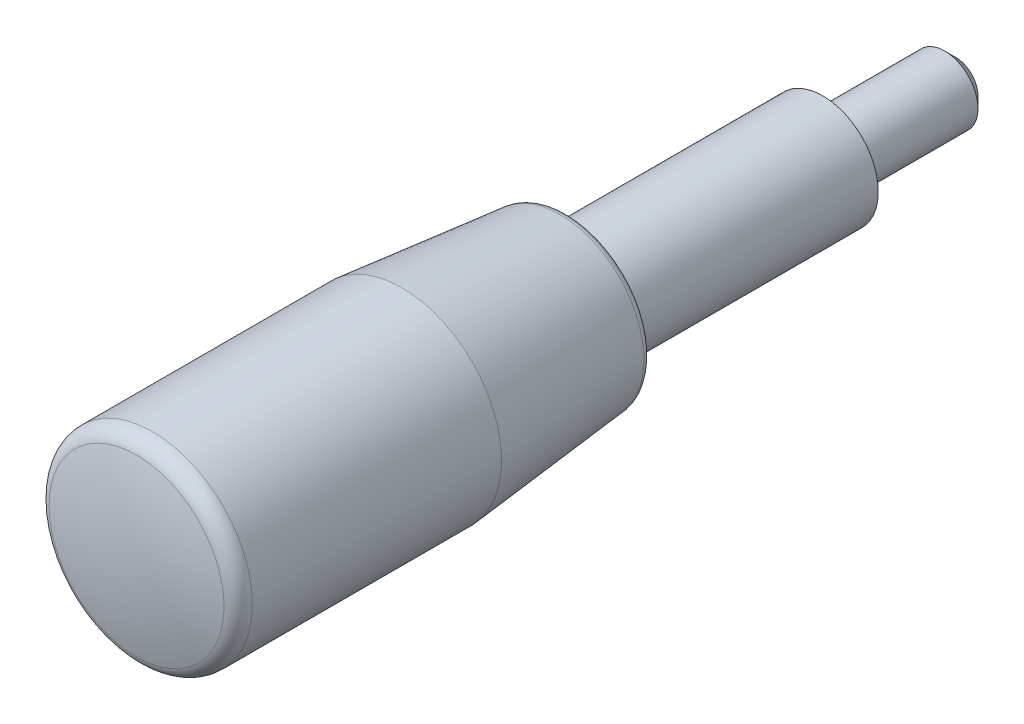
ISO-10303-21;
HEADER;
FILE_DESCRIPTION(('STEP AP214'),'2;1');
FILE_NAME('part.step','',(''),(''),'','','');
FILE_SCHEMA(('AUTOMOTIVE_DESIGN { 1 0 10303 214 1 1 1 1 }'));
ENDSEC;
DATA;
#1=APPLICATION_CONTEXT('core data for automotive mechanical design processes');
#2=APPLICATION_PROTOCOL_DEFINITION('international standard','automotive_design',2000,#1);
#3=PRODUCT_CONTEXT('',#1,'mechanical');
#4=PRODUCT('Part','Part','',(#3));
#5=PRODUCT_RELATED_PRODUCT_CATEGORY('part','',(#4));
#6=PRODUCT_DEFINITION_FORMATION('','',#4);
#7=PRODUCT_DEFINITION_CONTEXT('part definition',#1,'design');
#8=PRODUCT_DEFINITION('design','',#6,#7);
#9=PRODUCT_DEFINITION_SHAPE('','',#8);
#10=(LENGTH_UNIT() NAMED_UNIT(*) SI_UNIT(.MILLI.,.METRE.));
#11=(NAMED_UNIT(*) PLANE_ANGLE_UNIT() SI_UNIT($,.RADIAN.));
#12=(NAMED_UNIT(*) SI_UNIT($,.STERADIAN.) SOLID_ANGLE_UNIT());
#13=UNCERTAINTY_MEASURE_WITH_UNIT(LENGTH_MEASURE(1.E-05),#10,'distance_accuracy_value','');
#14=(GEOMETRIC_REPRESENTATION_CONTEXT(3) GLOBAL_UNCERTAINTY_ASSIGNED_CONTEXT((#13)) GLOBAL_UNIT_ASSIGNED_CONTEXT((#10,
#11,#12)) REPRESENTATION_CONTEXT('',''));
#15=CARTESIAN_POINT('',(0.,0.,0.));
#16=DIRECTION('',(0.,0.,1.));
#17=DIRECTION('',(1.,0.,0.));
#18=AXIS2_PLACEMENT_3D('',#15,#16,#17);
#19=CARTESIAN_POINT('',(0.,0.,-21.3556849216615));
#20=DIRECTION('',(0.,0.,-1.));
#21=DIRECTION('',(-1.,0.,0.));
#22=AXIS2_PLACEMENT_3D('',#19,#20,#21);
#23=CYLINDRICAL_SURFACE('',#22,3.);
#24=CARTESIAN_POINT('',(0.,0.,-11.));
#25=DIRECTION('',(0.,0.,-1.));
#26=DIRECTION('',(-1.,0.,0.));
#27=AXIS2_PLACEMENT_3D('',#24,#25,#26);
#28=CIRCLE('',#27,3.);
#29=CARTESIAN_POINT('',(-3.,0.,-11.));
#30=VERTEX_POINT('',#29);
#31=EDGE_CURVE('E8',#30,#30,#28,.T.);
#32=ORIENTED_EDGE('',*,*,#31,.F.);
#33=EDGE_LOOP('',(#32));
#34=FACE_BOUND('',#33,.T.);
#35=CARTESIAN_POINT('',(0.,0.,0.));
#36=DIRECTION('',(0.,0.,-1.));
#37=DIRECTION('',(-1.,0.,0.));
#38=AXIS2_PLACEMENT_3D('',#35,#36,#37);
#39=CIRCLE('',#38,3.);
#40=CARTESIAN_POINT('',(-3.,0.,0.));
#41=VERTEX_POINT('',#40);
#42=EDGE_CURVE('E46',#41,#41,#39,.T.);
#43=ORIENTED_EDGE('',*,*,#42,.T.);
#44=EDGE_LOOP('',(#43));
#45=FACE_BOUND('',#44,.T.);
#46=ADVANCED_FACE('F12',(#34,#45),#23,.T.);
#47=CARTESIAN_POINT('',(0.,0.,-11.));
#48=DIRECTION('',(0.,0.,1.));
#49=DIRECTION('',(1.,0.,0.));
#50=AXIS2_PLACEMENT_3D('',#47,#48,#49);
#51=CONICAL_SURFACE('',#50,3.,0.785398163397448);
#52=CARTESIAN_POINT('',(0.,0.,-12.));
#53=DIRECTION('',(0.,0.,-1.));
#54=DIRECTION('',(-1.,0.,0.));
#55=AXIS2_PLACEMENT_3D('',#52,#53,#54);
#56=CIRCLE('',#55,2.00000000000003);
#57=CARTESIAN_POINT('',(-2.00000000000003,0.,-12.));
#58=VERTEX_POINT('',#57);
#59=EDGE_CURVE('E18',#58,#58,#56,.T.);
#60=ORIENTED_EDGE('',*,*,#59,.F.);
#61=EDGE_LOOP('',(#60));
#62=FACE_BOUND('',#61,.T.);
#63=ORIENTED_EDGE('',*,*,#31,.T.);
#64=EDGE_LOOP('',(#63));
#65=FACE_BOUND('',#64,.T.);
#66=ADVANCED_FACE('F102',(#62,#65),#51,.T.);
#67=CARTESIAN_POINT('',(0.,1.99999999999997,-12.));
#68=DIRECTION('',(0.,0.,1.));
#69=DIRECTION('',(1.,0.,0.));
#70=AXIS2_PLACEMENT_3D('',#67,#68,#69);
#71=PLANE('',#70);
#72=ORIENTED_EDGE('',*,*,#59,.T.);
#73=EDGE_LOOP('',(#72));
#74=FACE_BOUND('',#73,.T.);
#75=ADVANCED_FACE('F95',(#74),#71,.F.);
#76=CARTESIAN_POINT('',(0.,0.,33.));
#77=DIRECTION('',(-1.,0.,0.));
#78=DIRECTION('',(0.,0.,1.));
#79=AXIS2_PLACEMENT_3D('',#76,#77,#78);
#80=SPHERICAL_SURFACE('',#79,30.);
#81=CARTESIAN_POINT('',(0.,0.,33.));
#82=DIRECTION('',(0.,0.,-1.));
#83=DIRECTION('',(-1.,0.,0.));
#84=AXIS2_PLACEMENT_3D('',#81,#82,#83);
#85=SPHERICAL_SURFACE('',#84,30.);
#86=CARTESIAN_POINT('',(0.,0.,61.942583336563));
#87=DIRECTION('',(0.,0.,-1.));
#88=DIRECTION('',(-1.,0.,0.));
#89=AXIS2_PLACEMENT_3D('',#86,#87,#88);
#90=CIRCLE('',#89,7.89473684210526);
#91=CARTESIAN_POINT('',(-7.89473684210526,0.,61.942583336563));
#92=VERTEX_POINT('',#91);
#93=EDGE_CURVE('E22',#92,#92,#90,.T.);
#94=ORIENTED_EDGE('',*,*,#93,.F.);
#95=EDGE_LOOP('',(#94));
#96=FACE_BOUND('',#95,.T.);
#97=ADVANCED_FACE('F90',(#96),#85,.T.);
#98=CARTESIAN_POINT('',(0.,0.,60.495454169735));
#99=DIRECTION('',(0.,0.,-1.));
#100=DIRECTION('',(-1.,0.,0.));
#101=AXIS2_PLACEMENT_3D('',#98,#99,#100);
#102=TOROIDAL_SURFACE('',#101,7.5,1.5);
#103=CARTESIAN_POINT('',(0.,0.,60.495454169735));
#104=DIRECTION('',(0.,0.,-1.));
#105=DIRECTION('',(-1.,0.,0.));
#106=AXIS2_PLACEMENT_3D('',#103,#104,#105);
#107=CIRCLE('',#106,9.);
#108=CARTESIAN_POINT('',(-9.,0.,60.495454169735));
#109=VERTEX_POINT('',#108);
#110=EDGE_CURVE('E26',#109,#109,#107,.T.);
#111=ORIENTED_EDGE('',*,*,#110,.F.);
#112=EDGE_LOOP('',(#111));
#113=FACE_BOUND('',#112,.T.);
#114=ORIENTED_EDGE('',*,*,#93,.T.);
#115=EDGE_LOOP('',(#114));
#116=FACE_BOUND('',#115,.T.);
#117=ADVANCED_FACE('F84',(#113,#116),#102,.T.);
#118=CARTESIAN_POINT('',(0.,0.,-21.3556849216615));
#119=DIRECTION('',(0.,0.,-1.));
#120=DIRECTION('',(-1.,0.,0.));
#121=AXIS2_PLACEMENT_3D('',#118,#119,#120);
#122=CYLINDRICAL_SURFACE('',#121,9.);
#123=CARTESIAN_POINT('',(0.,0.,38.));
#124=DIRECTION('',(0.,0.,-1.));
#125=DIRECTION('',(-1.,0.,0.));
#126=AXIS2_PLACEMENT_3D('',#123,#124,#125);
#127=CIRCLE('',#126,9.);
#128=CARTESIAN_POINT('',(-9.,0.,38.));
#129=VERTEX_POINT('',#128);
#130=EDGE_CURVE('E31',#129,#129,#127,.T.);
#131=ORIENTED_EDGE('',*,*,#130,.F.);
#132=EDGE_LOOP('',(#131));
#133=FACE_BOUND('',#132,.T.);
#134=ORIENTED_EDGE('',*,*,#110,.T.);
#135=EDGE_LOOP('',(#134));
#136=FACE_BOUND('',#135,.T.);
#137=ADVANCED_FACE('F78',(#133,#136),#122,.T.);
#138=CARTESIAN_POINT('',(0.,0.,38.));
#139=DIRECTION('',(0.,0.,1.));
#140=DIRECTION('',(1.,0.,0.));
#141=AXIS2_PLACEMENT_3D('',#138,#139,#140);
#142=CONICAL_SURFACE('',#141,9.,0.0996686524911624);
#143=CARTESIAN_POINT('',(0.,0.,23.7203970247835));
#144=DIRECTION('',(0.,0.,-1.));
#145=DIRECTION('',(-1.,0.,0.));
#146=AXIS2_PLACEMENT_3D('',#143,#144,#145);
#147=CIRCLE('',#146,7.5720397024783);
#148=CARTESIAN_POINT('',(-7.5720397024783,0.,23.7203970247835));
#149=VERTEX_POINT('',#148);
#150=EDGE_CURVE('E34',#149,#149,#147,.T.);
#151=ORIENTED_EDGE('',*,*,#150,.F.);
#152=EDGE_LOOP('',(#151));
#153=FACE_BOUND('',#152,.T.);
#154=ORIENTED_EDGE('',*,*,#130,.T.);
#155=EDGE_LOOP('',(#154));
#156=FACE_BOUND('',#155,.T.);
#157=ADVANCED_FACE('F72',(#153,#156),#142,.T.);
#158=CARTESIAN_POINT('',(0.,0.,23.8));
#159=DIRECTION('',(0.,0.,-1.));
#160=DIRECTION('',(-1.,0.,0.));
#161=AXIS2_PLACEMENT_3D('',#158,#159,#160);
#162=TOROIDAL_SURFACE('',#161,6.7760099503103,0.8);
#163=CARTESIAN_POINT('',(0.,0.,23.));
#164=DIRECTION('',(0.,0.,-1.));
#165=DIRECTION('',(-1.,0.,0.));
#166=AXIS2_PLACEMENT_3D('',#163,#164,#165);
#167=CIRCLE('',#166,6.7760099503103);
#168=CARTESIAN_POINT('',(-6.7760099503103,0.,23.));
#169=VERTEX_POINT('',#168);
#170=EDGE_CURVE('E37',#169,#169,#167,.T.);
#171=ORIENTED_EDGE('',*,*,#170,.F.);
#172=EDGE_LOOP('',(#171));
#173=FACE_BOUND('',#172,.T.);
#174=ORIENTED_EDGE('',*,*,#150,.T.);
#175=EDGE_LOOP('',(#174));
#176=FACE_BOUND('',#175,.T.);
#177=ADVANCED_FACE('F66',(#173,#176),#162,.T.);
#178=CARTESIAN_POINT('',(0.,6.77600995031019,23.));
#179=DIRECTION('',(0.,0.,1.));
#180=DIRECTION('',(1.,0.,0.));
#181=AXIS2_PLACEMENT_3D('',#178,#179,#180);
#182=PLANE('',#181);
#183=CARTESIAN_POINT('',(0.,0.,23.));
#184=DIRECTION('',(0.,0.,-1.));
#185=DIRECTION('',(-1.,0.,0.));
#186=AXIS2_PLACEMENT_3D('',#183,#184,#185);
#187=CIRCLE('',#186,5.);
#188=CARTESIAN_POINT('',(-5.,0.,23.));
#189=VERTEX_POINT('',#188);
#190=EDGE_CURVE('E40',#189,#189,#187,.T.);
#191=ORIENTED_EDGE('',*,*,#190,.F.);
#192=EDGE_LOOP('',(#191));
#193=FACE_BOUND('',#192,.T.);
#194=ORIENTED_EDGE('',*,*,#170,.T.);
#195=EDGE_LOOP('',(#194));
#196=FACE_BOUND('',#195,.T.);
#197=ADVANCED_FACE('F60',(#193,#196),#182,.F.);
#198=CARTESIAN_POINT('',(0.,0.,-21.3556849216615));
#199=DIRECTION('',(0.,0.,-1.));
#200=DIRECTION('',(-1.,0.,0.));
#201=AXIS2_PLACEMENT_3D('',#198,#199,#200);
#202=CYLINDRICAL_SURFACE('',#201,5.);
#203=CARTESIAN_POINT('',(0.,0.,0.));
#204=DIRECTION('',(0.,0.,-1.));
#205=DIRECTION('',(-1.,0.,0.));
#206=AXIS2_PLACEMENT_3D('',#203,#204,#205);
#207=CIRCLE('',#206,5.);
#208=CARTESIAN_POINT('',(-5.,0.,0.));
#209=VERTEX_POINT('',#208);
#210=EDGE_CURVE('E43',#209,#209,#207,.T.);
#211=ORIENTED_EDGE('',*,*,#210,.F.);
#212=EDGE_LOOP('',(#211));
#213=FACE_BOUND('',#212,.T.);
#214=ORIENTED_EDGE('',*,*,#190,.T.);
#215=EDGE_LOOP('',(#214));
#216=FACE_BOUND('',#215,.T.);
#217=ADVANCED_FACE('F54',(#213,#216),#202,.T.);
#218=CARTESIAN_POINT('',(0.,5.,0.));
#219=DIRECTION('',(0.,0.,1.));
#220=DIRECTION('',(1.,0.,0.));
#221=AXIS2_PLACEMENT_3D('',#218,#219,#220);
#222=PLANE('',#221);
#223=ORIENTED_EDGE('',*,*,#42,.F.);
#224=EDGE_LOOP('',(#223));
#225=FACE_BOUND('',#224,.T.);
#226=ORIENTED_EDGE('',*,*,#210,.T.);
#227=EDGE_LOOP('',(#226));
#228=FACE_BOUND('',#227,.T.);
#229=ADVANCED_FACE('F51',(#225,#228),#222,.F.);
#230=CLOSED_SHELL('',(#46,#66,#75,#97,#117,#137,#157,#177,#197,#217,#229));
#231=MANIFOLD_SOLID_BREP('B1',#230);
#232=ADVANCED_BREP_SHAPE_REPRESENTATION('',(#18,#231),#14);
#233=SHAPE_DEFINITION_REPRESENTATION(#9,#232);
ENDSEC;
END-ISO-10303-21;
